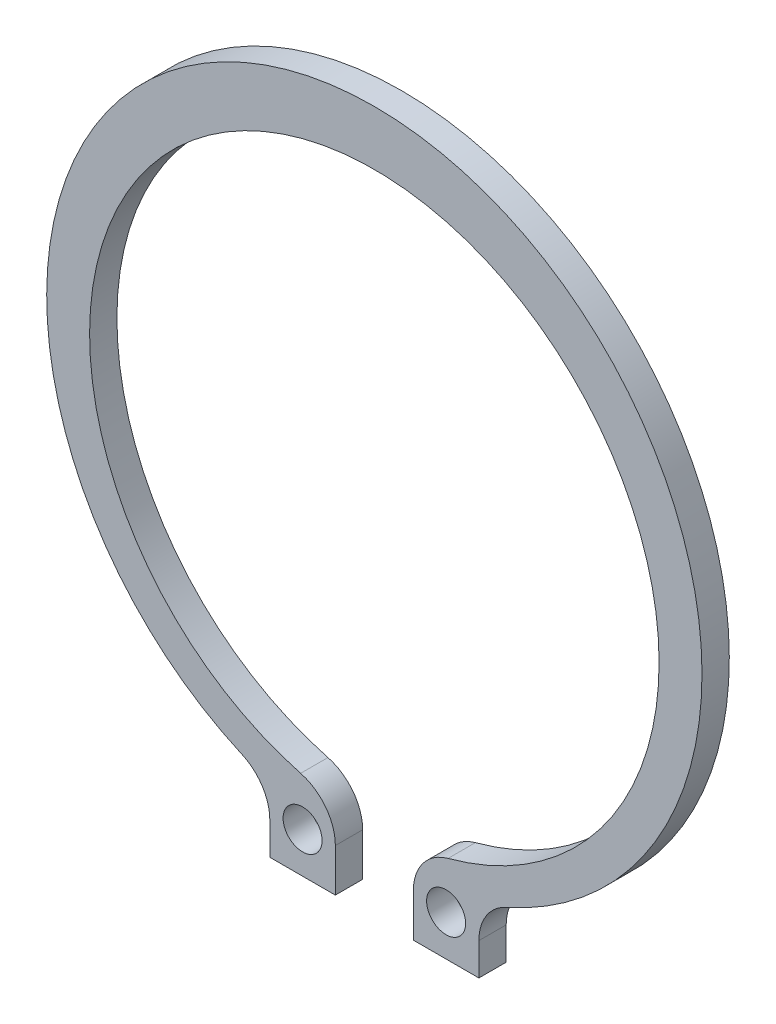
ISO-10303-21;
HEADER;
FILE_DESCRIPTION(('STEP AP214'),'2;1');
FILE_NAME('part.step','',(''),(''),'','','');
FILE_SCHEMA(('AUTOMOTIVE_DESIGN { 1 0 10303 214 1 1 1 1 }'));
ENDSEC;
DATA;
#1=APPLICATION_CONTEXT('core data for automotive mechanical design processes');
#2=APPLICATION_PROTOCOL_DEFINITION('international standard','automotive_design',2000,#1);
#3=PRODUCT_CONTEXT('',#1,'mechanical');
#4=PRODUCT('Part','Part','',(#3));
#5=PRODUCT_RELATED_PRODUCT_CATEGORY('part','',(#4));
#6=PRODUCT_DEFINITION_FORMATION('','',#4);
#7=PRODUCT_DEFINITION_CONTEXT('part definition',#1,'design');
#8=PRODUCT_DEFINITION('design','',#6,#7);
#9=PRODUCT_DEFINITION_SHAPE('','',#8);
#10=(LENGTH_UNIT() NAMED_UNIT(*) SI_UNIT(.MILLI.,.METRE.));
#11=(NAMED_UNIT(*) PLANE_ANGLE_UNIT() SI_UNIT($,.RADIAN.));
#12=(NAMED_UNIT(*) SI_UNIT($,.STERADIAN.) SOLID_ANGLE_UNIT());
#13=UNCERTAINTY_MEASURE_WITH_UNIT(LENGTH_MEASURE(1.E-05),#10,'distance_accuracy_value','');
#14=(GEOMETRIC_REPRESENTATION_CONTEXT(3) GLOBAL_UNCERTAINTY_ASSIGNED_CONTEXT((#13)) GLOBAL_UNIT_ASSIGNED_CONTEXT((#10,
#11,#12)) REPRESENTATION_CONTEXT('',''));
#15=CARTESIAN_POINT('',(0.,0.,0.));
#16=DIRECTION('',(0.,0.,1.));
#17=DIRECTION('',(1.,0.,0.));
#18=AXIS2_PLACEMENT_3D('',#15,#16,#17);
#19=CARTESIAN_POINT('',(0.,0.75,1.75));
#20=DIRECTION('',(0.,0.,-1.));
#21=DIRECTION('',(-1.,0.,0.));
#22=AXIS2_PLACEMENT_3D('',#19,#20,#21);
#23=CYLINDRICAL_SURFACE('',#22,21.);
#24=CARTESIAN_POINT('',(0.,0.75,0.));
#25=DIRECTION('',(0.,0.,1.));
#26=DIRECTION('',(1.,0.,0.));
#27=AXIS2_PLACEMENT_3D('',#24,#25,#26);
#28=CIRCLE('',#27,21.);
#29=CARTESIAN_POINT('',(8.4875,-18.4583925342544,0.));
#30=VERTEX_POINT('',#29);
#31=CARTESIAN_POINT('',(-8.4875,-18.4583925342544,0.));
#32=VERTEX_POINT('',#31);
#33=EDGE_CURVE('E164',#30,#32,#28,.T.);
#34=ORIENTED_EDGE('',*,*,#33,.T.);
#35=DIRECTION('',(0.,0.,-1.));
#36=VECTOR('',#35,1.);
#37=CARTESIAN_POINT('',(-8.4875,-18.4583925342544,1.75));
#38=LINE('',#37,#36);
#39=CARTESIAN_POINT('',(-8.4875,-18.4583925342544,1.75));
#40=VERTEX_POINT('',#39);
#41=EDGE_CURVE('E193',#32,#40,#38,.F.);
#42=ORIENTED_EDGE('',*,*,#41,.T.);
#43=CARTESIAN_POINT('',(0.,0.75,1.75));
#44=DIRECTION('',(0.,0.,1.));
#45=DIRECTION('',(1.,0.,0.));
#46=AXIS2_PLACEMENT_3D('',#43,#44,#45);
#47=CIRCLE('',#46,21.);
#48=CARTESIAN_POINT('',(8.4875,-18.4583925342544,1.75));
#49=VERTEX_POINT('',#48);
#50=EDGE_CURVE('E135',#49,#40,#47,.T.);
#51=ORIENTED_EDGE('',*,*,#50,.F.);
#52=DIRECTION('',(0.,0.,-1.));
#53=VECTOR('',#52,1.);
#54=CARTESIAN_POINT('',(8.4875,-18.4583925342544,1.75));
#55=LINE('',#54,#53);
#56=EDGE_CURVE('E190',#49,#30,#55,.T.);
#57=ORIENTED_EDGE('',*,*,#56,.T.);
#58=EDGE_LOOP('',(#34,#42,#51,#57));
#59=FACE_BOUND('',#58,.T.);
#60=ADVANCED_FACE('F33',(#59),#23,.T.);
#61=CARTESIAN_POINT('',(-6.7,-19.1525124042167,1.75));
#62=DIRECTION('',(1.,0.,0.));
#63=DIRECTION('',(0.,1.,0.));
#64=AXIS2_PLACEMENT_3D('',#61,#62,#63);
#65=PLANE('',#64);
#66=DIRECTION('',(0.,-1.,0.));
#67=VECTOR('',#66,1.);
#68=CARTESIAN_POINT('',(-6.7,-19.1525124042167,1.75));
#69=LINE('',#68,#67);
#70=CARTESIAN_POINT('',(-6.7,-21.2024486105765,1.75));
#71=VERTEX_POINT('',#70);
#72=CARTESIAN_POINT('',(-6.7,-23.2779561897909,1.75));
#73=VERTEX_POINT('',#72);
#74=EDGE_CURVE('E123',#71,#73,#69,.T.);
#75=ORIENTED_EDGE('',*,*,#74,.F.);
#76=DIRECTION('',(0.,0.,1.));
#77=VECTOR('',#76,1.);
#78=CARTESIAN_POINT('',(-6.7,-21.2024486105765,0.));
#79=LINE('',#78,#77);
#80=CARTESIAN_POINT('',(-6.7,-21.2024486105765,0.));
#81=VERTEX_POINT('',#80);
#82=EDGE_CURVE('E144',#71,#81,#79,.F.);
#83=ORIENTED_EDGE('',*,*,#82,.T.);
#84=DIRECTION('',(0.,-1.,0.));
#85=VECTOR('',#84,1.);
#86=CARTESIAN_POINT('',(-6.7,-19.1525124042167,0.));
#87=LINE('',#86,#85);
#88=CARTESIAN_POINT('',(-6.7,-23.2779561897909,0.));
#89=VERTEX_POINT('',#88);
#90=EDGE_CURVE('E141',#81,#89,#87,.T.);
#91=ORIENTED_EDGE('',*,*,#90,.T.);
#92=DIRECTION('',(0.,0.,-1.));
#93=VECTOR('',#92,1.);
#94=CARTESIAN_POINT('',(-6.7,-23.2779561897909,1.75));
#95=LINE('',#94,#93);
#96=EDGE_CURVE('E138',#73,#89,#95,.T.);
#97=ORIENTED_EDGE('',*,*,#96,.F.);
#98=EDGE_LOOP('',(#75,#83,#91,#97));
#99=FACE_BOUND('',#98,.T.);
#100=ADVANCED_FACE('F139',(#99),#65,.F.);
#101=CARTESIAN_POINT('',(-6.7,-23.2779561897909,1.75));
#102=DIRECTION('',(0.,1.,0.));
#103=DIRECTION('',(-1.,0.,0.));
#104=AXIS2_PLACEMENT_3D('',#101,#102,#103);
#105=PLANE('',#104);
#106=DIRECTION('',(1.,0.,0.));
#107=VECTOR('',#106,1.);
#108=CARTESIAN_POINT('',(-6.7,-23.2779561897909,0.));
#109=LINE('',#108,#107);
#110=CARTESIAN_POINT('',(-2.5,-23.2779561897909,0.));
#111=VERTEX_POINT('',#110);
#112=EDGE_CURVE('E169',#89,#111,#109,.T.);
#113=ORIENTED_EDGE('',*,*,#112,.T.);
#114=DIRECTION('',(0.,0.,-1.));
#115=VECTOR('',#114,1.);
#116=CARTESIAN_POINT('',(-2.5,-23.2779561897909,1.75));
#117=LINE('',#116,#115);
#118=CARTESIAN_POINT('',(-2.5,-23.2779561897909,1.75));
#119=VERTEX_POINT('',#118);
#120=EDGE_CURVE('E145',#119,#111,#117,.T.);
#121=ORIENTED_EDGE('',*,*,#120,.F.);
#122=DIRECTION('',(1.,0.,0.));
#123=VECTOR('',#122,1.);
#124=CARTESIAN_POINT('',(-6.7,-23.2779561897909,1.75));
#125=LINE('',#124,#123);
#126=EDGE_CURVE('E127',#73,#119,#125,.T.);
#127=ORIENTED_EDGE('',*,*,#126,.F.);
#128=ORIENTED_EDGE('',*,*,#96,.T.);
#129=EDGE_LOOP('',(#113,#121,#127,#128));
#130=FACE_BOUND('',#129,.T.);
#131=ADVANCED_FACE('F147',(#130),#105,.F.);
#132=CARTESIAN_POINT('',(-2.5,-23.2779561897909,1.75));
#133=DIRECTION('',(-1.,0.,0.));
#134=DIRECTION('',(0.,0.,1.));
#135=AXIS2_PLACEMENT_3D('',#132,#133,#134);
#136=PLANE('',#135);
#137=DIRECTION('',(0.,1.,0.));
#138=VECTOR('',#137,1.);
#139=CARTESIAN_POINT('',(-2.5,-23.2779561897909,0.));
#140=LINE('',#139,#138);
#141=CARTESIAN_POINT('',(-2.5,-20.525898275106,0.));
#142=VERTEX_POINT('',#141);
#143=EDGE_CURVE('E171',#111,#142,#140,.T.);
#144=ORIENTED_EDGE('',*,*,#143,.T.);
#145=DIRECTION('',(0.,0.,-1.));
#146=VECTOR('',#145,1.);
#147=CARTESIAN_POINT('',(-2.5,-20.525898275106,1.75));
#148=LINE('',#147,#146);
#149=CARTESIAN_POINT('',(-2.5,-20.525898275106,1.75));
#150=VERTEX_POINT('',#149);
#151=EDGE_CURVE('E56',#142,#150,#148,.F.);
#152=ORIENTED_EDGE('',*,*,#151,.T.);
#153=DIRECTION('',(0.,1.,0.));
#154=VECTOR('',#153,1.);
#155=CARTESIAN_POINT('',(-2.5,-23.2779561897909,1.75));
#156=LINE('',#155,#154);
#157=EDGE_CURVE('E149',#119,#150,#156,.T.);
#158=ORIENTED_EDGE('',*,*,#157,.F.);
#159=ORIENTED_EDGE('',*,*,#120,.T.);
#160=EDGE_LOOP('',(#144,#152,#158,#159));
#161=FACE_BOUND('',#160,.T.);
#162=ADVANCED_FACE('F226',(#161),#136,.F.);
#163=CARTESIAN_POINT('',(0.,0.,1.75));
#164=DIRECTION('',(0.,0.,-1.));
#165=DIRECTION('',(-1.,0.,0.));
#166=AXIS2_PLACEMENT_3D('',#163,#164,#165);
#167=CYLINDRICAL_SURFACE('',#166,18.25);
#168=CARTESIAN_POINT('',(0.,0.,1.75));
#169=DIRECTION('',(0.,0.,-1.));
#170=DIRECTION('',(1.,0.,0.));
#171=AXIS2_PLACEMENT_3D('',#168,#169,#170);
#172=CIRCLE('',#171,18.25);
#173=CARTESIAN_POINT('',(-4.72352941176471,-17.6281244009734,1.75));
#174=VERTEX_POINT('',#173);
#175=CARTESIAN_POINT('',(4.72352941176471,-17.6281244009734,1.75));
#176=VERTEX_POINT('',#175);
#177=EDGE_CURVE('E151',#174,#176,#172,.T.);
#178=ORIENTED_EDGE('',*,*,#177,.F.);
#179=DIRECTION('',(0.,0.,-1.));
#180=VECTOR('',#179,1.);
#181=CARTESIAN_POINT('',(-4.72352941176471,-17.6281244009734,1.75));
#182=LINE('',#181,#180);
#183=CARTESIAN_POINT('',(-4.72352941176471,-17.6281244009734,0.));
#184=VERTEX_POINT('',#183);
#185=EDGE_CURVE('E206',#174,#184,#182,.T.);
#186=ORIENTED_EDGE('',*,*,#185,.T.);
#187=CARTESIAN_POINT('',(0.,0.,0.));
#188=DIRECTION('',(0.,0.,-1.));
#189=DIRECTION('',(1.,0.,0.));
#190=AXIS2_PLACEMENT_3D('',#187,#188,#189);
#191=CIRCLE('',#190,18.25);
#192=CARTESIAN_POINT('',(4.72352941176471,-17.6281244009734,0.));
#193=VERTEX_POINT('',#192);
#194=EDGE_CURVE('E173',#184,#193,#191,.T.);
#195=ORIENTED_EDGE('',*,*,#194,.T.);
#196=DIRECTION('',(0.,0.,-1.));
#197=VECTOR('',#196,1.);
#198=CARTESIAN_POINT('',(4.72352941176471,-17.6281244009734,1.75));
#199=LINE('',#198,#197);
#200=EDGE_CURVE('E204',#193,#176,#199,.F.);
#201=ORIENTED_EDGE('',*,*,#200,.T.);
#202=EDGE_LOOP('',(#178,#186,#195,#201));
#203=FACE_BOUND('',#202,.T.);
#204=ADVANCED_FACE('F219',(#203),#167,.F.);
#205=CARTESIAN_POINT('',(2.5,-18.0779561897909,1.75));
#206=DIRECTION('',(1.,0.,0.));
#207=DIRECTION('',(0.,0.,-1.));
#208=AXIS2_PLACEMENT_3D('',#205,#206,#207);
#209=PLANE('',#208);
#210=DIRECTION('',(0.,-1.,0.));
#211=VECTOR('',#210,1.);
#212=CARTESIAN_POINT('',(2.5,-18.0779561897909,1.75));
#213=LINE('',#212,#211);
#214=CARTESIAN_POINT('',(2.5,-20.525898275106,1.75));
#215=VERTEX_POINT('',#214);
#216=CARTESIAN_POINT('',(2.5,-23.2779561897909,1.75));
#217=VERTEX_POINT('',#216);
#218=EDGE_CURVE('E156',#215,#217,#213,.T.);
#219=ORIENTED_EDGE('',*,*,#218,.F.);
#220=DIRECTION('',(0.,0.,-1.));
#221=VECTOR('',#220,1.);
#222=CARTESIAN_POINT('',(2.5,-20.525898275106,1.75));
#223=LINE('',#222,#221);
#224=CARTESIAN_POINT('',(2.5,-20.525898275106,0.));
#225=VERTEX_POINT('',#224);
#226=EDGE_CURVE('E11',#215,#225,#223,.T.);
#227=ORIENTED_EDGE('',*,*,#226,.T.);
#228=DIRECTION('',(0.,-1.,0.));
#229=VECTOR('',#228,1.);
#230=CARTESIAN_POINT('',(2.5,-18.0779561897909,0.));
#231=LINE('',#230,#229);
#232=CARTESIAN_POINT('',(2.5,-23.2779561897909,0.));
#233=VERTEX_POINT('',#232);
#234=EDGE_CURVE('E176',#225,#233,#231,.T.);
#235=ORIENTED_EDGE('',*,*,#234,.T.);
#236=DIRECTION('',(0.,0.,-1.));
#237=VECTOR('',#236,1.);
#238=CARTESIAN_POINT('',(2.5,-23.2779561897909,1.75));
#239=LINE('',#238,#237);
#240=EDGE_CURVE('E185',#217,#233,#239,.T.);
#241=ORIENTED_EDGE('',*,*,#240,.F.);
#242=EDGE_LOOP('',(#219,#227,#235,#241));
#243=FACE_BOUND('',#242,.T.);
#244=ADVANCED_FACE('F233',(#243),#209,.F.);
#245=CARTESIAN_POINT('',(2.5,-23.2779561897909,1.75));
#246=DIRECTION('',(0.,1.,0.));
#247=DIRECTION('',(-1.,0.,0.));
#248=AXIS2_PLACEMENT_3D('',#245,#246,#247);
#249=PLANE('',#248);
#250=DIRECTION('',(1.,0.,0.));
#251=VECTOR('',#250,1.);
#252=CARTESIAN_POINT('',(2.5,-23.2779561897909,0.));
#253=LINE('',#252,#251);
#254=CARTESIAN_POINT('',(6.7,-23.2779561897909,0.));
#255=VERTEX_POINT('',#254);
#256=EDGE_CURVE('E178',#233,#255,#253,.T.);
#257=ORIENTED_EDGE('',*,*,#256,.T.);
#258=DIRECTION('',(0.,0.,-1.));
#259=VECTOR('',#258,1.);
#260=CARTESIAN_POINT('',(6.7,-23.2779561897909,1.75));
#261=LINE('',#260,#259);
#262=CARTESIAN_POINT('',(6.7,-23.2779561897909,1.75));
#263=VERTEX_POINT('',#262);
#264=EDGE_CURVE('E163',#263,#255,#261,.T.);
#265=ORIENTED_EDGE('',*,*,#264,.F.);
#266=DIRECTION('',(1.,0.,0.));
#267=VECTOR('',#266,1.);
#268=CARTESIAN_POINT('',(2.5,-23.2779561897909,1.75));
#269=LINE('',#268,#267);
#270=EDGE_CURVE('E158',#217,#263,#269,.T.);
#271=ORIENTED_EDGE('',*,*,#270,.F.);
#272=ORIENTED_EDGE('',*,*,#240,.T.);
#273=EDGE_LOOP('',(#257,#265,#271,#272));
#274=FACE_BOUND('',#273,.T.);
#275=ADVANCED_FACE('F271',(#274),#249,.F.);
#276=CARTESIAN_POINT('',(6.7,-23.2779561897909,1.75));
#277=DIRECTION('',(-1.,0.,0.));
#278=DIRECTION('',(0.,-1.,0.));
#279=AXIS2_PLACEMENT_3D('',#276,#277,#278);
#280=PLANE('',#279);
#281=DIRECTION('',(0.,1.,0.));
#282=VECTOR('',#281,1.);
#283=CARTESIAN_POINT('',(6.7,-23.2779561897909,0.));
#284=LINE('',#283,#282);
#285=CARTESIAN_POINT('',(6.7,-21.2024486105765,0.));
#286=VERTEX_POINT('',#285);
#287=EDGE_CURVE('E180',#255,#286,#284,.T.);
#288=ORIENTED_EDGE('',*,*,#287,.T.);
#289=DIRECTION('',(0.,0.,1.));
#290=VECTOR('',#289,1.);
#291=CARTESIAN_POINT('',(6.7,-21.2024486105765,1.75));
#292=LINE('',#291,#290);
#293=CARTESIAN_POINT('',(6.7,-21.2024486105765,1.75));
#294=VERTEX_POINT('',#293);
#295=EDGE_CURVE('E195',#286,#294,#292,.T.);
#296=ORIENTED_EDGE('',*,*,#295,.T.);
#297=DIRECTION('',(0.,1.,0.));
#298=VECTOR('',#297,1.);
#299=CARTESIAN_POINT('',(6.7,-23.2779561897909,1.75));
#300=LINE('',#299,#298);
#301=EDGE_CURVE('E160',#263,#294,#300,.T.);
#302=ORIENTED_EDGE('',*,*,#301,.F.);
#303=ORIENTED_EDGE('',*,*,#264,.T.);
#304=EDGE_LOOP('',(#288,#296,#302,#303));
#305=FACE_BOUND('',#304,.T.);
#306=ADVANCED_FACE('F275',(#305),#280,.F.);
#307=CARTESIAN_POINT('',(0.,0.75,1.75));
#308=DIRECTION('',(0.,0.,1.));
#309=DIRECTION('',(1.,0.,0.));
#310=AXIS2_PLACEMENT_3D('',#307,#308,#309);
#311=PLANE('',#310);
#312=CARTESIAN_POINT('',(-4.6,-20.6779561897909,1.75));
#313=DIRECTION('',(0.,0.,1.));
#314=DIRECTION('',(1.,0.,0.));
#315=AXIS2_PLACEMENT_3D('',#312,#313,#314);
#316=CIRCLE('',#315,1.25);
#317=CARTESIAN_POINT('',(-3.35,-20.6779561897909,1.75));
#318=VERTEX_POINT('',#317);
#319=EDGE_CURVE('E286',#318,#318,#316,.T.);
#320=ORIENTED_EDGE('',*,*,#319,.F.);
#321=EDGE_LOOP('',(#320));
#322=FACE_BOUND('',#321,.T.);
#323=CARTESIAN_POINT('',(4.6,-20.6779561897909,1.75));
#324=DIRECTION('',(0.,0.,-1.));
#325=DIRECTION('',(-1.,0.,0.));
#326=AXIS2_PLACEMENT_3D('',#323,#324,#325);
#327=CIRCLE('',#326,1.25);
#328=CARTESIAN_POINT('',(3.35,-20.6779561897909,1.75));
#329=VERTEX_POINT('',#328);
#330=EDGE_CURVE('E167',#329,#329,#327,.T.);
#331=ORIENTED_EDGE('',*,*,#330,.T.);
#332=EDGE_LOOP('',(#331));
#333=FACE_BOUND('',#332,.T.);
#334=ORIENTED_EDGE('',*,*,#157,.T.);
#335=CARTESIAN_POINT('',(-5.5,-20.525898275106,1.75));
#336=DIRECTION('',(0.,0.,1.));
#337=DIRECTION('',(1.,0.,0.));
#338=AXIS2_PLACEMENT_3D('',#335,#336,#337);
#339=CIRCLE('',#338,3.);
#340=EDGE_CURVE('E41',#150,#174,#339,.T.);
#341=ORIENTED_EDGE('',*,*,#340,.T.);
#342=ORIENTED_EDGE('',*,*,#177,.T.);
#343=CARTESIAN_POINT('',(5.5,-20.525898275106,1.75));
#344=DIRECTION('',(0.,0.,1.));
#345=DIRECTION('',(1.,0.,0.));
#346=AXIS2_PLACEMENT_3D('',#343,#344,#345);
#347=CIRCLE('',#346,3.);
#348=EDGE_CURVE('E48',#176,#215,#347,.T.);
#349=ORIENTED_EDGE('',*,*,#348,.T.);
#350=ORIENTED_EDGE('',*,*,#218,.T.);
#351=ORIENTED_EDGE('',*,*,#270,.T.);
#352=ORIENTED_EDGE('',*,*,#301,.T.);
#353=CARTESIAN_POINT('',(9.7,-21.2024486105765,1.75));
#354=DIRECTION('',(0.,0.,1.));
#355=DIRECTION('',(1.,0.,0.));
#356=AXIS2_PLACEMENT_3D('',#353,#354,#355);
#357=CIRCLE('',#356,3.);
#358=EDGE_CURVE('E202',#294,#49,#357,.F.);
#359=ORIENTED_EDGE('',*,*,#358,.T.);
#360=ORIENTED_EDGE('',*,*,#50,.T.);
#361=CARTESIAN_POINT('',(-9.7,-21.2024486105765,1.75));
#362=DIRECTION('',(0.,0.,1.));
#363=DIRECTION('',(1.,0.,0.));
#364=AXIS2_PLACEMENT_3D('',#361,#362,#363);
#365=CIRCLE('',#364,3.);
#366=EDGE_CURVE('E131',#40,#71,#365,.F.);
#367=ORIENTED_EDGE('',*,*,#366,.T.);
#368=ORIENTED_EDGE('',*,*,#74,.T.);
#369=ORIENTED_EDGE('',*,*,#126,.T.);
#370=EDGE_LOOP('',(#334,#341,#342,#349,#350,#351,#352,#359,#360,#367,#368,#369));
#371=FACE_BOUND('',#370,.T.);
#372=ADVANCED_FACE('F125',(#322,#333,#371),#311,.T.);
#373=CARTESIAN_POINT('',(0.,0.75,0.));
#374=DIRECTION('',(0.,0.,1.));
#375=DIRECTION('',(1.,0.,0.));
#376=AXIS2_PLACEMENT_3D('',#373,#374,#375);
#377=PLANE('',#376);
#378=CARTESIAN_POINT('',(-4.6,-20.6779561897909,0.));
#379=DIRECTION('',(0.,0.,1.));
#380=DIRECTION('',(1.,0.,0.));
#381=AXIS2_PLACEMENT_3D('',#378,#379,#380);
#382=CIRCLE('',#381,1.25);
#383=CARTESIAN_POINT('',(-3.35,-20.6779561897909,0.));
#384=VERTEX_POINT('',#383);
#385=EDGE_CURVE('E289',#384,#384,#382,.T.);
#386=ORIENTED_EDGE('',*,*,#385,.T.);
#387=EDGE_LOOP('',(#386));
#388=FACE_BOUND('',#387,.T.);
#389=CARTESIAN_POINT('',(4.6,-20.6779561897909,0.));
#390=DIRECTION('',(0.,0.,-1.));
#391=DIRECTION('',(-1.,0.,0.));
#392=AXIS2_PLACEMENT_3D('',#389,#390,#391);
#393=CIRCLE('',#392,1.25);
#394=CARTESIAN_POINT('',(3.35,-20.6779561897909,0.));
#395=VERTEX_POINT('',#394);
#396=EDGE_CURVE('E283',#395,#395,#393,.T.);
#397=ORIENTED_EDGE('',*,*,#396,.F.);
#398=EDGE_LOOP('',(#397));
#399=FACE_BOUND('',#398,.T.);
#400=ORIENTED_EDGE('',*,*,#194,.F.);
#401=CARTESIAN_POINT('',(-5.5,-20.525898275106,0.));
#402=DIRECTION('',(0.,0.,1.));
#403=DIRECTION('',(1.,0.,0.));
#404=AXIS2_PLACEMENT_3D('',#401,#402,#403);
#405=CIRCLE('',#404,3.);
#406=EDGE_CURVE('E211',#184,#142,#405,.F.);
#407=ORIENTED_EDGE('',*,*,#406,.T.);
#408=ORIENTED_EDGE('',*,*,#143,.F.);
#409=ORIENTED_EDGE('',*,*,#112,.F.);
#410=ORIENTED_EDGE('',*,*,#90,.F.);
#411=CARTESIAN_POINT('',(-9.7,-21.2024486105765,0.));
#412=DIRECTION('',(0.,0.,1.));
#413=DIRECTION('',(1.,0.,0.));
#414=AXIS2_PLACEMENT_3D('',#411,#412,#413);
#415=CIRCLE('',#414,3.);
#416=EDGE_CURVE('E197',#81,#32,#415,.T.);
#417=ORIENTED_EDGE('',*,*,#416,.T.);
#418=ORIENTED_EDGE('',*,*,#33,.F.);
#419=CARTESIAN_POINT('',(9.7,-21.2024486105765,0.));
#420=DIRECTION('',(0.,0.,1.));
#421=DIRECTION('',(1.,0.,0.));
#422=AXIS2_PLACEMENT_3D('',#419,#420,#421);
#423=CIRCLE('',#422,3.);
#424=EDGE_CURVE('E200',#30,#286,#423,.T.);
#425=ORIENTED_EDGE('',*,*,#424,.T.);
#426=ORIENTED_EDGE('',*,*,#287,.F.);
#427=ORIENTED_EDGE('',*,*,#256,.F.);
#428=ORIENTED_EDGE('',*,*,#234,.F.);
#429=CARTESIAN_POINT('',(5.5,-20.525898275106,0.));
#430=DIRECTION('',(0.,0.,1.));
#431=DIRECTION('',(1.,0.,0.));
#432=AXIS2_PLACEMENT_3D('',#429,#430,#431);
#433=CIRCLE('',#432,3.);
#434=EDGE_CURVE('E209',#225,#193,#433,.F.);
#435=ORIENTED_EDGE('',*,*,#434,.T.);
#436=EDGE_LOOP('',(#400,#407,#408,#409,#410,#417,#418,#425,#426,#427,#428,#435));
#437=FACE_BOUND('',#436,.T.);
#438=ADVANCED_FACE('F225',(#388,#399,#437),#377,.F.);
#439=CARTESIAN_POINT('',(4.6,-20.6779561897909,1.75));
#440=DIRECTION('',(0.,0.,-1.));
#441=DIRECTION('',(-1.,0.,0.));
#442=AXIS2_PLACEMENT_3D('',#439,#440,#441);
#443=CYLINDRICAL_SURFACE('',#442,1.25);
#444=ORIENTED_EDGE('',*,*,#330,.F.);
#445=EDGE_LOOP('',(#444));
#446=FACE_BOUND('',#445,.T.);
#447=ORIENTED_EDGE('',*,*,#396,.T.);
#448=EDGE_LOOP('',(#447));
#449=FACE_BOUND('',#448,.T.);
#450=ADVANCED_FACE('F248',(#446,#449),#443,.F.);
#451=CARTESIAN_POINT('',(-9.7,-21.2024486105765,1.75));
#452=DIRECTION('',(0.,0.,-1.));
#453=DIRECTION('',(-1.,0.,0.));
#454=AXIS2_PLACEMENT_3D('',#451,#452,#453);
#455=CYLINDRICAL_SURFACE('',#454,3.);
#456=ORIENTED_EDGE('',*,*,#366,.F.);
#457=ORIENTED_EDGE('',*,*,#41,.F.);
#458=ORIENTED_EDGE('',*,*,#416,.F.);
#459=ORIENTED_EDGE('',*,*,#82,.F.);
#460=EDGE_LOOP('',(#456,#457,#458,#459));
#461=FACE_BOUND('',#460,.T.);
#462=ADVANCED_FACE('F244',(#461),#455,.F.);
#463=CARTESIAN_POINT('',(9.7,-21.2024486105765,1.75));
#464=DIRECTION('',(0.,0.,-1.));
#465=DIRECTION('',(-1.,0.,0.));
#466=AXIS2_PLACEMENT_3D('',#463,#464,#465);
#467=CYLINDRICAL_SURFACE('',#466,3.);
#468=ORIENTED_EDGE('',*,*,#358,.F.);
#469=ORIENTED_EDGE('',*,*,#295,.F.);
#470=ORIENTED_EDGE('',*,*,#424,.F.);
#471=ORIENTED_EDGE('',*,*,#56,.F.);
#472=EDGE_LOOP('',(#468,#469,#470,#471));
#473=FACE_BOUND('',#472,.T.);
#474=ADVANCED_FACE('F247',(#473),#467,.F.);
#475=CARTESIAN_POINT('',(-5.5,-20.525898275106,1.75));
#476=DIRECTION('',(0.,0.,-1.));
#477=DIRECTION('',(-1.,0.,0.));
#478=AXIS2_PLACEMENT_3D('',#475,#476,#477);
#479=CYLINDRICAL_SURFACE('',#478,3.);
#480=ORIENTED_EDGE('',*,*,#340,.F.);
#481=ORIENTED_EDGE('',*,*,#151,.F.);
#482=ORIENTED_EDGE('',*,*,#406,.F.);
#483=ORIENTED_EDGE('',*,*,#185,.F.);
#484=EDGE_LOOP('',(#480,#481,#482,#483));
#485=FACE_BOUND('',#484,.T.);
#486=ADVANCED_FACE('F222',(#485),#479,.T.);
#487=CARTESIAN_POINT('',(5.5,-20.525898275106,1.75));
#488=DIRECTION('',(0.,0.,-1.));
#489=DIRECTION('',(-1.,0.,0.));
#490=AXIS2_PLACEMENT_3D('',#487,#488,#489);
#491=CYLINDRICAL_SURFACE('',#490,3.);
#492=ORIENTED_EDGE('',*,*,#348,.F.);
#493=ORIENTED_EDGE('',*,*,#200,.F.);
#494=ORIENTED_EDGE('',*,*,#434,.F.);
#495=ORIENTED_EDGE('',*,*,#226,.F.);
#496=EDGE_LOOP('',(#492,#493,#494,#495));
#497=FACE_BOUND('',#496,.T.);
#498=ADVANCED_FACE('F35',(#497),#491,.T.);
#499=CARTESIAN_POINT('',(-4.6,-20.6779561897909,1.75));
#500=DIRECTION('',(0.,0.,-1.));
#501=DIRECTION('',(-1.,0.,0.));
#502=AXIS2_PLACEMENT_3D('',#499,#500,#501);
#503=CYLINDRICAL_SURFACE('',#502,1.25);
#504=ORIENTED_EDGE('',*,*,#319,.T.);
#505=EDGE_LOOP('',(#504));
#506=FACE_BOUND('',#505,.T.);
#507=ORIENTED_EDGE('',*,*,#385,.F.);
#508=EDGE_LOOP('',(#507));
#509=FACE_BOUND('',#508,.T.);
#510=ADVANCED_FACE('F256',(#506,#509),#503,.F.);
#511=CLOSED_SHELL('',(#60,#100,#131,#162,#204,#244,#275,#306,#372,#438,#450,#462,#474,#486,#498,#510));
#512=MANIFOLD_SOLID_BREP('B2',#511);
#513=ADVANCED_BREP_SHAPE_REPRESENTATION('',(#18,#512),#14);
#514=SHAPE_DEFINITION_REPRESENTATION(#9,#513);
ENDSEC;
END-ISO-10303-21;
